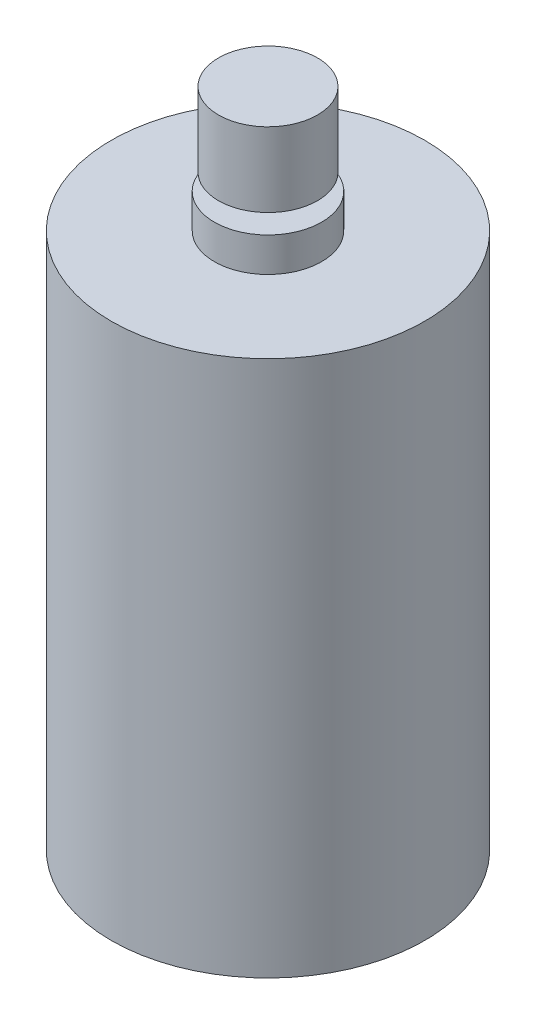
from build123d import *

# Parameters (mm, degrees)
SKIZZE1_R                       = 19
AUFSATZ_LINEAR_AUSTRAGEN1_DEPTH = 65
SKIZZE2_R                       = 6.5
AUFSATZ_LINEAR_AUSTRAGEN2_DEPTH = 4.15
SKIZZE3_R                       = 1
AUFSATZ_LINEAR_AUSTRAGEN3_DEPTH = 2
SKIZZE4_R                       = 6
AUFSATZ_LINEAR_AUSTRAGEN4_DEPTH = 9


with BuildPart() as part:
    # Skizze1 → Aufsatz-Linear austragen1 (new body)
    with BuildSketch(Plane(origin=(0, 0, 0), x_dir=(1, 0, 0), z_dir=(0, 1, 0))):
        with Locations(Location((0, 0, 0), (0, 0, 270))):
            Circle(SKIZZE1_R)
    extrude(amount=AUFSATZ_LINEAR_AUSTRAGEN1_DEPTH)

    # Skizze2 → Aufsatz-Linear austragen2 (add)
    with BuildSketch(Plane(origin=(0, 65, 0), x_dir=(1, 0, 0), z_dir=(0, 1, 0))):
        with Locations(Location((0, 0, 0), (0, 0, 90))):
            Circle(SKIZZE2_R)
    extrude(amount=AUFSATZ_LINEAR_AUSTRAGEN2_DEPTH)

    # Skizze3 → Aufsatz-Linear austragen3 (add)
    with BuildSketch(Plane(origin=(0, 69.15, 0), x_dir=(1, 0, 0), z_dir=(0, 1, 0))):
        with Locations(Location((0, 0, 0), (0, 0, 270))):
            Circle(SKIZZE3_R)
    extrude(amount=AUFSATZ_LINEAR_AUSTRAGEN3_DEPTH)

    # Skizze4 → Aufsatz-Linear austragen4 (add)
    with BuildSketch(Plane(origin=(0, 71.15, 0), x_dir=(1, 0, 0), z_dir=(0, 1, 0))):
        with Locations(Location((0, 0, 0), (0, 0, 270))):
            Circle(SKIZZE4_R)
    extrude(amount=AUFSATZ_LINEAR_AUSTRAGEN4_DEPTH)


solid = part.part
